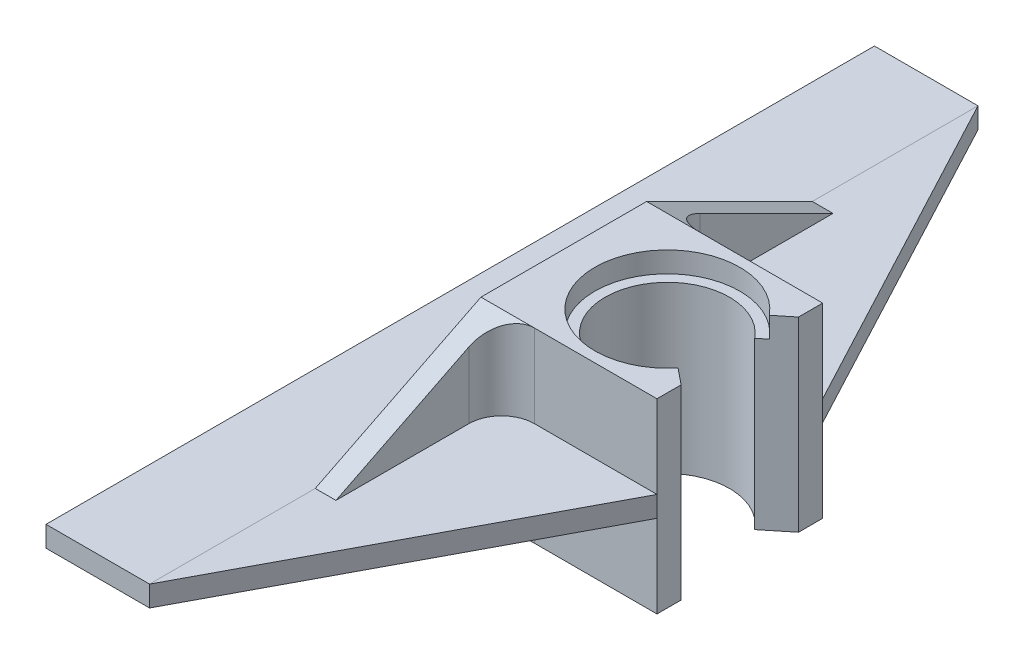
ISO-10303-21;
HEADER;
FILE_DESCRIPTION(('STEP AP214'),'2;1');
FILE_NAME('part.step','',(''),(''),'','','');
FILE_SCHEMA(('AUTOMOTIVE_DESIGN { 1 0 10303 214 1 1 1 1 }'));
ENDSEC;
DATA;
#1=APPLICATION_CONTEXT('core data for automotive mechanical design processes');
#2=APPLICATION_PROTOCOL_DEFINITION('international standard','automotive_design',2000,#1);
#3=PRODUCT_CONTEXT('',#1,'mechanical');
#4=PRODUCT('Part','Part','',(#3));
#5=PRODUCT_RELATED_PRODUCT_CATEGORY('part','',(#4));
#6=PRODUCT_DEFINITION_FORMATION('','',#4);
#7=PRODUCT_DEFINITION_CONTEXT('part definition',#1,'design');
#8=PRODUCT_DEFINITION('design','',#6,#7);
#9=PRODUCT_DEFINITION_SHAPE('','',#8);
#10=(LENGTH_UNIT() NAMED_UNIT(*) SI_UNIT(.MILLI.,.METRE.));
#11=(NAMED_UNIT(*) PLANE_ANGLE_UNIT() SI_UNIT($,.RADIAN.));
#12=(NAMED_UNIT(*) SI_UNIT($,.STERADIAN.) SOLID_ANGLE_UNIT());
#13=UNCERTAINTY_MEASURE_WITH_UNIT(LENGTH_MEASURE(1.E-05),#10,'distance_accuracy_value','');
#14=(GEOMETRIC_REPRESENTATION_CONTEXT(3) GLOBAL_UNCERTAINTY_ASSIGNED_CONTEXT((#13)) GLOBAL_UNIT_ASSIGNED_CONTEXT((#10,
#11,#12)) REPRESENTATION_CONTEXT('',''));
#15=CARTESIAN_POINT('',(0.,0.,0.));
#16=DIRECTION('',(0.,0.,1.));
#17=DIRECTION('',(1.,0.,0.));
#18=AXIS2_PLACEMENT_3D('',#15,#16,#17);
#19=CARTESIAN_POINT('',(-10.,-1.,-8.));
#20=DIRECTION('',(0.,1.,0.));
#21=DIRECTION('',(0.,0.,1.));
#22=AXIS2_PLACEMENT_3D('',#19,#20,#21);
#23=PLANE('',#22);
#24=DIRECTION('',(0.,0.,1.));
#25=VECTOR('',#24,1.);
#26=CARTESIAN_POINT('',(-10.,-1.,-8.));
#27=LINE('',#26,#25);
#28=CARTESIAN_POINT('',(-10.,-1.,-40.));
#29=VERTEX_POINT('',#28);
#30=CARTESIAN_POINT('',(-10.,-0.999999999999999,-24.));
#31=VERTEX_POINT('',#30);
#32=EDGE_CURVE('E11',#29,#31,#27,.T.);
#33=ORIENTED_EDGE('',*,*,#32,.F.);
#34=DIRECTION('',(-0.469155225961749,0.,-0.883115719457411));
#35=VECTOR('',#34,1.);
#36=CARTESIAN_POINT('',(7.,-1.,-8.));
#37=LINE('',#36,#35);
#38=CARTESIAN_POINT('',(7.,-1.,-8.));
#39=VERTEX_POINT('',#38);
#40=EDGE_CURVE('E526',#39,#29,#37,.T.);
#41=ORIENTED_EDGE('',*,*,#40,.F.);
#42=DIRECTION('',(1.,0.,0.));
#43=VECTOR('',#42,1.);
#44=CARTESIAN_POINT('',(7.,-1.,-8.));
#45=LINE('',#44,#43);
#46=CARTESIAN_POINT('',(-4.825,-1.,-8.));
#47=VERTEX_POINT('',#46);
#48=EDGE_CURVE('E429',#47,#39,#45,.T.);
#49=ORIENTED_EDGE('',*,*,#48,.F.);
#50=CARTESIAN_POINT('',(-4.825,-0.999999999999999,-11.175));
#51=DIRECTION('',(0.,1.,0.));
#52=DIRECTION('',(0.,0.,1.));
#53=AXIS2_PLACEMENT_3D('',#50,#51,#52);
#54=CIRCLE('',#53,3.175);
#55=CARTESIAN_POINT('',(-8.,-1.,-11.175));
#56=VERTEX_POINT('',#55);
#57=EDGE_CURVE('E317',#47,#56,#54,.F.);
#58=ORIENTED_EDGE('',*,*,#57,.T.);
#59=DIRECTION('',(0.,0.,-1.));
#60=VECTOR('',#59,1.);
#61=CARTESIAN_POINT('',(-8.,-1.,-8.));
#62=LINE('',#61,#60);
#63=CARTESIAN_POINT('',(-8.,-1.,-24.));
#64=VERTEX_POINT('',#63);
#65=EDGE_CURVE('E522',#56,#64,#62,.T.);
#66=ORIENTED_EDGE('',*,*,#65,.T.);
#67=DIRECTION('',(-1.,0.,0.));
#68=VECTOR('',#67,1.);
#69=CARTESIAN_POINT('',(-10.,-1.,-24.));
#70=LINE('',#69,#68);
#71=EDGE_CURVE('E306',#64,#31,#70,.T.);
#72=ORIENTED_EDGE('',*,*,#71,.T.);
#73=EDGE_LOOP('',(#33,#41,#49,#58,#66,#72));
#74=FACE_BOUND('',#73,.T.);
#75=ADVANCED_FACE('F32',(#74),#23,.F.);
#76=CARTESIAN_POINT('',(-10.,-0.999999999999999,24.));
#77=VERTEX_POINT('',#76);
#78=CARTESIAN_POINT('',(-10.,-1.,40.));
#79=VERTEX_POINT('',#78);
#80=EDGE_CURVE('E43',#77,#79,#27,.T.);
#81=ORIENTED_EDGE('',*,*,#80,.F.);
#82=DIRECTION('',(1.,0.,0.));
#83=VECTOR('',#82,1.);
#84=CARTESIAN_POINT('',(-10.,-1.,24.));
#85=LINE('',#84,#83);
#86=CARTESIAN_POINT('',(-8.,-1.,24.));
#87=VERTEX_POINT('',#86);
#88=EDGE_CURVE('E309',#77,#87,#85,.T.);
#89=ORIENTED_EDGE('',*,*,#88,.T.);
#90=CARTESIAN_POINT('',(-8.,-1.,11.175));
#91=VERTEX_POINT('',#90);
#92=EDGE_CURVE('E413',#87,#91,#62,.T.);
#93=ORIENTED_EDGE('',*,*,#92,.T.);
#94=CARTESIAN_POINT('',(-4.825,-0.999999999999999,11.175));
#95=DIRECTION('',(0.,1.,0.));
#96=DIRECTION('',(0.,0.,1.));
#97=AXIS2_PLACEMENT_3D('',#94,#95,#96);
#98=CIRCLE('',#97,3.175);
#99=CARTESIAN_POINT('',(-4.825,-1.,8.));
#100=VERTEX_POINT('',#99);
#101=EDGE_CURVE('E315',#91,#100,#98,.F.);
#102=ORIENTED_EDGE('',*,*,#101,.T.);
#103=DIRECTION('',(-1.,0.,0.));
#104=VECTOR('',#103,1.);
#105=CARTESIAN_POINT('',(-10.,-1.,8.));
#106=LINE('',#105,#104);
#107=CARTESIAN_POINT('',(7.,-1.,8.));
#108=VERTEX_POINT('',#107);
#109=EDGE_CURVE('E398',#108,#100,#106,.T.);
#110=ORIENTED_EDGE('',*,*,#109,.F.);
#111=DIRECTION('',(0.469155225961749,0.,-0.883115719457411));
#112=VECTOR('',#111,1.);
#113=CARTESIAN_POINT('',(7.,-1.,8.));
#114=LINE('',#113,#112);
#115=EDGE_CURVE('E387',#79,#108,#114,.T.);
#116=ORIENTED_EDGE('',*,*,#115,.F.);
#117=EDGE_LOOP('',(#81,#89,#93,#102,#110,#116));
#118=FACE_BOUND('',#117,.T.);
#119=ADVANCED_FACE('F396',(#118),#23,.F.);
#120=CARTESIAN_POINT('',(-10.,1.,-8.));
#121=DIRECTION('',(0.,1.,0.));
#122=DIRECTION('',(0.,0.,1.));
#123=AXIS2_PLACEMENT_3D('',#120,#121,#122);
#124=PLANE('',#123);
#125=DIRECTION('',(-0.469155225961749,0.,-0.883115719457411));
#126=VECTOR('',#125,1.);
#127=CARTESIAN_POINT('',(7.,1.,-8.));
#128=LINE('',#127,#126);
#129=CARTESIAN_POINT('',(7.,1.,-8.));
#130=VERTEX_POINT('',#129);
#131=CARTESIAN_POINT('',(-10.,1.,-40.));
#132=VERTEX_POINT('',#131);
#133=EDGE_CURVE('E412',#130,#132,#128,.T.);
#134=ORIENTED_EDGE('',*,*,#133,.T.);
#135=DIRECTION('',(0.,0.,1.));
#136=VECTOR('',#135,1.);
#137=CARTESIAN_POINT('',(-10.,1.,-8.));
#138=LINE('',#137,#136);
#139=CARTESIAN_POINT('',(-10.,1.,-24.));
#140=VERTEX_POINT('',#139);
#141=EDGE_CURVE('E351',#132,#140,#138,.T.);
#142=ORIENTED_EDGE('',*,*,#141,.T.);
#143=DIRECTION('',(-1.,0.,0.));
#144=VECTOR('',#143,1.);
#145=CARTESIAN_POINT('',(-10.,1.,-24.));
#146=LINE('',#145,#144);
#147=CARTESIAN_POINT('',(-8.,1.,-24.));
#148=VERTEX_POINT('',#147);
#149=EDGE_CURVE('E221',#148,#140,#146,.T.);
#150=ORIENTED_EDGE('',*,*,#149,.F.);
#151=DIRECTION('',(0.,0.,-1.));
#152=VECTOR('',#151,1.);
#153=CARTESIAN_POINT('',(-8.,1.,-8.));
#154=LINE('',#153,#152);
#155=CARTESIAN_POINT('',(-8.,1.,-11.175));
#156=VERTEX_POINT('',#155);
#157=EDGE_CURVE('E300',#156,#148,#154,.T.);
#158=ORIENTED_EDGE('',*,*,#157,.F.);
#159=CARTESIAN_POINT('',(-4.825,0.999999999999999,-11.175));
#160=DIRECTION('',(0.,1.,0.));
#161=DIRECTION('',(0.,0.,1.));
#162=AXIS2_PLACEMENT_3D('',#159,#160,#161);
#163=CIRCLE('',#162,3.175);
#164=CARTESIAN_POINT('',(-4.825,1.,-8.));
#165=VERTEX_POINT('',#164);
#166=EDGE_CURVE('E329',#156,#165,#163,.T.);
#167=ORIENTED_EDGE('',*,*,#166,.T.);
#168=DIRECTION('',(1.,0.,0.));
#169=VECTOR('',#168,1.);
#170=CARTESIAN_POINT('',(7.,1.,-8.));
#171=LINE('',#170,#169);
#172=EDGE_CURVE('E410',#165,#130,#171,.T.);
#173=ORIENTED_EDGE('',*,*,#172,.T.);
#174=EDGE_LOOP('',(#134,#142,#150,#158,#167,#173));
#175=FACE_BOUND('',#174,.T.);
#176=ADVANCED_FACE('F567',(#175),#124,.T.);
#177=DIRECTION('',(1.,0.,0.));
#178=VECTOR('',#177,1.);
#179=CARTESIAN_POINT('',(-10.,1.,24.));
#180=LINE('',#179,#178);
#181=CARTESIAN_POINT('',(-10.,1.,24.));
#182=VERTEX_POINT('',#181);
#183=CARTESIAN_POINT('',(-8.,1.,24.));
#184=VERTEX_POINT('',#183);
#185=EDGE_CURVE('E303',#182,#184,#180,.T.);
#186=ORIENTED_EDGE('',*,*,#185,.F.);
#187=CARTESIAN_POINT('',(-10.,1.,40.));
#188=VERTEX_POINT('',#187);
#189=EDGE_CURVE('E36',#182,#188,#138,.T.);
#190=ORIENTED_EDGE('',*,*,#189,.T.);
#191=DIRECTION('',(0.469155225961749,0.,-0.883115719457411));
#192=VECTOR('',#191,1.);
#193=CARTESIAN_POINT('',(7.,1.,8.));
#194=LINE('',#193,#192);
#195=CARTESIAN_POINT('',(7.,1.,8.));
#196=VERTEX_POINT('',#195);
#197=EDGE_CURVE('E389',#188,#196,#194,.T.);
#198=ORIENTED_EDGE('',*,*,#197,.T.);
#199=DIRECTION('',(-1.,0.,0.));
#200=VECTOR('',#199,1.);
#201=CARTESIAN_POINT('',(-10.,1.,8.));
#202=LINE('',#201,#200);
#203=CARTESIAN_POINT('',(-4.825,1.,8.));
#204=VERTEX_POINT('',#203);
#205=EDGE_CURVE('E424',#196,#204,#202,.T.);
#206=ORIENTED_EDGE('',*,*,#205,.T.);
#207=CARTESIAN_POINT('',(-4.825,0.999999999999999,11.175));
#208=DIRECTION('',(0.,1.,0.));
#209=DIRECTION('',(0.,0.,1.));
#210=AXIS2_PLACEMENT_3D('',#207,#208,#209);
#211=CIRCLE('',#210,3.175);
#212=CARTESIAN_POINT('',(-8.,1.,11.175));
#213=VERTEX_POINT('',#212);
#214=EDGE_CURVE('E331',#204,#213,#211,.T.);
#215=ORIENTED_EDGE('',*,*,#214,.T.);
#216=EDGE_CURVE('E304',#184,#213,#154,.T.);
#217=ORIENTED_EDGE('',*,*,#216,.F.);
#218=EDGE_LOOP('',(#186,#190,#198,#206,#215,#217));
#219=FACE_BOUND('',#218,.T.);
#220=ADVANCED_FACE('F559',(#219),#124,.T.);
#221=CARTESIAN_POINT('',(-10.,9.,-8.));
#222=DIRECTION('',(1.,0.,0.));
#223=DIRECTION('',(0.,0.,-1.));
#224=AXIS2_PLACEMENT_3D('',#221,#222,#223);
#225=PLANE('',#224);
#226=DIRECTION('',(0.,0.,-1.));
#227=VECTOR('',#226,1.);
#228=CARTESIAN_POINT('',(-10.,-1.,-8.));
#229=LINE('',#228,#227);
#230=EDGE_CURVE('E378',#77,#31,#229,.T.);
#231=ORIENTED_EDGE('',*,*,#230,.T.);
#232=DIRECTION('',(0.,-0.447213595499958,0.894427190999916));
#233=VECTOR('',#232,1.);
#234=CARTESIAN_POINT('',(-10.,0.,-26.));
#235=LINE('',#234,#233);
#236=CARTESIAN_POINT('',(-10.,-9.,-8.));
#237=VERTEX_POINT('',#236);
#238=EDGE_CURVE('E225',#31,#237,#235,.T.);
#239=ORIENTED_EDGE('',*,*,#238,.T.);
#240=DIRECTION('',(0.,0.,1.));
#241=VECTOR('',#240,1.);
#242=CARTESIAN_POINT('',(-10.,-9.,-8.));
#243=LINE('',#242,#241);
#244=CARTESIAN_POINT('',(-10.,-9.,8.));
#245=VERTEX_POINT('',#244);
#246=EDGE_CURVE('E260',#237,#245,#243,.T.);
#247=ORIENTED_EDGE('',*,*,#246,.T.);
#248=DIRECTION('',(0.,0.447213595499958,0.894427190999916));
#249=VECTOR('',#248,1.);
#250=CARTESIAN_POINT('',(-10.,0.,26.));
#251=LINE('',#250,#249);
#252=EDGE_CURVE('E517',#245,#77,#251,.T.);
#253=ORIENTED_EDGE('',*,*,#252,.T.);
#254=EDGE_LOOP('',(#231,#239,#247,#253));
#255=FACE_BOUND('',#254,.T.);
#256=ADVANCED_FACE('F557',(#255),#225,.F.);
#257=CARTESIAN_POINT('',(-10.,9.,8.));
#258=DIRECTION('',(0.,0.,-1.));
#259=DIRECTION('',(-1.,0.,0.));
#260=AXIS2_PLACEMENT_3D('',#257,#258,#259);
#261=PLANE('',#260);
#262=ORIENTED_EDGE('',*,*,#109,.T.);
#263=DIRECTION('',(0.,-1.,0.));
#264=VECTOR('',#263,1.);
#265=CARTESIAN_POINT('',(-4.825,9.,8.));
#266=LINE('',#265,#264);
#267=CARTESIAN_POINT('',(-4.825,-9.,8.));
#268=VERTEX_POINT('',#267);
#269=EDGE_CURVE('E321',#100,#268,#266,.T.);
#270=ORIENTED_EDGE('',*,*,#269,.T.);
#271=DIRECTION('',(1.,0.,0.));
#272=VECTOR('',#271,1.);
#273=CARTESIAN_POINT('',(-10.,-9.,8.));
#274=LINE('',#273,#272);
#275=CARTESIAN_POINT('',(7.,-9.,8.));
#276=VERTEX_POINT('',#275);
#277=EDGE_CURVE('E263',#268,#276,#274,.T.);
#278=ORIENTED_EDGE('',*,*,#277,.T.);
#279=DIRECTION('',(0.,-1.,0.));
#280=VECTOR('',#279,1.);
#281=CARTESIAN_POINT('',(7.,9.,8.));
#282=LINE('',#281,#280);
#283=EDGE_CURVE('E291',#108,#276,#282,.T.);
#284=ORIENTED_EDGE('',*,*,#283,.F.);
#285=EDGE_LOOP('',(#262,#270,#278,#284));
#286=FACE_BOUND('',#285,.T.);
#287=ADVANCED_FACE('F490',(#286),#261,.F.);
#288=CARTESIAN_POINT('',(-10.,9.,-8.));
#289=DIRECTION('',(0.,0.,1.));
#290=DIRECTION('',(1.,0.,0.));
#291=AXIS2_PLACEMENT_3D('',#288,#289,#290);
#292=PLANE('',#291);
#293=DIRECTION('',(-1.,0.,0.));
#294=VECTOR('',#293,1.);
#295=CARTESIAN_POINT('',(-10.,-9.,-8.));
#296=LINE('',#295,#294);
#297=CARTESIAN_POINT('',(7.,-9.,-8.));
#298=VERTEX_POINT('',#297);
#299=CARTESIAN_POINT('',(-4.825,-9.,-8.));
#300=VERTEX_POINT('',#299);
#301=EDGE_CURVE('E239',#298,#300,#296,.T.);
#302=ORIENTED_EDGE('',*,*,#301,.T.);
#303=DIRECTION('',(0.,1.,0.));
#304=VECTOR('',#303,1.);
#305=CARTESIAN_POINT('',(-4.825,9.,-8.));
#306=LINE('',#305,#304);
#307=EDGE_CURVE('E312',#300,#47,#306,.T.);
#308=ORIENTED_EDGE('',*,*,#307,.T.);
#309=ORIENTED_EDGE('',*,*,#48,.T.);
#310=DIRECTION('',(0.,-1.,0.));
#311=VECTOR('',#310,1.);
#312=CARTESIAN_POINT('',(7.,9.,-8.));
#313=LINE('',#312,#311);
#314=EDGE_CURVE('E259',#39,#298,#313,.T.);
#315=ORIENTED_EDGE('',*,*,#314,.T.);
#316=EDGE_LOOP('',(#302,#308,#309,#315));
#317=FACE_BOUND('',#316,.T.);
#318=ADVANCED_FACE('F542',(#317),#292,.F.);
#319=CARTESIAN_POINT('',(0.,9.,0.));
#320=DIRECTION('',(0.,-1.,0.));
#321=DIRECTION('',(0.,0.,-1.));
#322=AXIS2_PLACEMENT_3D('',#319,#320,#321);
#323=CYLINDRICAL_SURFACE('',#322,6.);
#324=CARTESIAN_POINT('',(0.,7.,0.));
#325=DIRECTION('',(0.,1.,0.));
#326=DIRECTION('',(0.,0.,1.));
#327=AXIS2_PLACEMENT_3D('',#324,#325,#326);
#328=CIRCLE('',#327,6.);
#329=CARTESIAN_POINT('',(4.66287576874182,7.,3.77592234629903));
#330=VERTEX_POINT('',#329);
#331=CARTESIAN_POINT('',(4.66287576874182,7.,-3.77592234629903));
#332=VERTEX_POINT('',#331);
#333=EDGE_CURVE('E447',#330,#332,#328,.F.);
#334=ORIENTED_EDGE('',*,*,#333,.F.);
#335=DIRECTION('',(0.,-1.,0.));
#336=VECTOR('',#335,1.);
#337=CARTESIAN_POINT('',(4.66287576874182,9.,3.77592234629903));
#338=LINE('',#337,#336);
#339=CARTESIAN_POINT('',(4.66287576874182,-9.,3.77592234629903));
#340=VERTEX_POINT('',#339);
#341=EDGE_CURVE('E286',#330,#340,#338,.T.);
#342=ORIENTED_EDGE('',*,*,#341,.T.);
#343=CARTESIAN_POINT('',(0.,-9.,0.));
#344=DIRECTION('',(0.,-1.,0.));
#345=DIRECTION('',(0.,0.,1.));
#346=AXIS2_PLACEMENT_3D('',#343,#344,#345);
#347=CIRCLE('',#346,6.);
#348=CARTESIAN_POINT('',(4.66287576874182,-9.,-3.77592234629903));
#349=VERTEX_POINT('',#348);
#350=EDGE_CURVE('E271',#340,#349,#347,.T.);
#351=ORIENTED_EDGE('',*,*,#350,.T.);
#352=DIRECTION('',(0.,-1.,0.));
#353=VECTOR('',#352,1.);
#354=CARTESIAN_POINT('',(4.66287576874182,9.,-3.77592234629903));
#355=LINE('',#354,#353);
#356=EDGE_CURVE('E284',#332,#349,#355,.T.);
#357=ORIENTED_EDGE('',*,*,#356,.F.);
#358=EDGE_LOOP('',(#334,#342,#351,#357));
#359=FACE_BOUND('',#358,.T.);
#360=ADVANCED_FACE('F458',(#359),#323,.F.);
#361=DIRECTION('',(0.,0.,1.));
#362=VECTOR('',#361,1.);
#363=CARTESIAN_POINT('',(-10.,9.,-8.));
#364=LINE('',#363,#362);
#365=CARTESIAN_POINT('',(-10.,9.,-8.));
#366=VERTEX_POINT('',#365);
#367=CARTESIAN_POINT('',(-10.,9.,8.));
#368=VERTEX_POINT('',#367);
#369=EDGE_CURVE('E229',#366,#368,#364,.T.);
#370=ORIENTED_EDGE('',*,*,#369,.F.);
#371=DIRECTION('',(0.,-0.447213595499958,-0.894427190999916));
#372=VECTOR('',#371,1.);
#373=CARTESIAN_POINT('',(-10.,9.,-8.));
#374=LINE('',#373,#372);
#375=EDGE_CURVE('E215',#366,#140,#374,.T.);
#376=ORIENTED_EDGE('',*,*,#375,.T.);
#377=DIRECTION('',(0.,0.,-1.));
#378=VECTOR('',#377,1.);
#379=CARTESIAN_POINT('',(-10.,1.,-8.));
#380=LINE('',#379,#378);
#381=EDGE_CURVE('E427',#182,#140,#380,.T.);
#382=ORIENTED_EDGE('',*,*,#381,.F.);
#383=DIRECTION('',(0.,0.447213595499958,-0.894427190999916));
#384=VECTOR('',#383,1.);
#385=CARTESIAN_POINT('',(-10.,9.,8.));
#386=LINE('',#385,#384);
#387=EDGE_CURVE('E237',#182,#368,#386,.T.);
#388=ORIENTED_EDGE('',*,*,#387,.T.);
#389=EDGE_LOOP('',(#370,#376,#382,#388));
#390=FACE_BOUND('',#389,.T.);
#391=ADVANCED_FACE('F235',(#390),#225,.F.);
#392=DIRECTION('',(1.,0.,0.));
#393=VECTOR('',#392,1.);
#394=CARTESIAN_POINT('',(-10.,9.,8.));
#395=LINE('',#394,#393);
#396=CARTESIAN_POINT('',(-4.825,9.,8.));
#397=VERTEX_POINT('',#396);
#398=CARTESIAN_POINT('',(7.,9.,8.));
#399=VERTEX_POINT('',#398);
#400=EDGE_CURVE('E238',#397,#399,#395,.T.);
#401=ORIENTED_EDGE('',*,*,#400,.F.);
#402=DIRECTION('',(0.,-1.,0.));
#403=VECTOR('',#402,1.);
#404=CARTESIAN_POINT('',(-4.825,9.,8.));
#405=LINE('',#404,#403);
#406=EDGE_CURVE('E326',#397,#204,#405,.T.);
#407=ORIENTED_EDGE('',*,*,#406,.T.);
#408=ORIENTED_EDGE('',*,*,#205,.F.);
#409=EDGE_CURVE('E292',#399,#196,#282,.T.);
#410=ORIENTED_EDGE('',*,*,#409,.F.);
#411=EDGE_LOOP('',(#401,#407,#408,#410));
#412=FACE_BOUND('',#411,.T.);
#413=ADVANCED_FACE('F566',(#412),#261,.F.);
#414=CARTESIAN_POINT('',(7.,9.,5.66848823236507));
#415=DIRECTION('',(-1.,0.,0.));
#416=DIRECTION('',(0.,0.,1.));
#417=AXIS2_PLACEMENT_3D('',#414,#415,#416);
#418=PLANE('',#417);
#419=DIRECTION('',(0.,0.,-1.));
#420=VECTOR('',#419,1.);
#421=CARTESIAN_POINT('',(7.,-9.,5.66848823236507));
#422=LINE('',#421,#420);
#423=CARTESIAN_POINT('',(7.,-9.,5.66848823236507));
#424=VERTEX_POINT('',#423);
#425=EDGE_CURVE('E266',#276,#424,#422,.T.);
#426=ORIENTED_EDGE('',*,*,#425,.T.);
#427=DIRECTION('',(0.,-1.,0.));
#428=VECTOR('',#427,1.);
#429=CARTESIAN_POINT('',(7.,9.,5.66848823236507));
#430=LINE('',#429,#428);
#431=CARTESIAN_POINT('',(7.,9.,5.66848823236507));
#432=VERTEX_POINT('',#431);
#433=EDGE_CURVE('E288',#432,#424,#430,.T.);
#434=ORIENTED_EDGE('',*,*,#433,.F.);
#435=DIRECTION('',(0.,0.,-1.));
#436=VECTOR('',#435,1.);
#437=CARTESIAN_POINT('',(7.,9.,5.66848823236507));
#438=LINE('',#437,#436);
#439=EDGE_CURVE('E249',#399,#432,#438,.T.);
#440=ORIENTED_EDGE('',*,*,#439,.F.);
#441=ORIENTED_EDGE('',*,*,#409,.T.);
#442=DIRECTION('',(0.,1.,0.));
#443=VECTOR('',#442,1.);
#444=CARTESIAN_POINT('',(7.,-1.,8.));
#445=LINE('',#444,#443);
#446=EDGE_CURVE('E393',#108,#196,#445,.T.);
#447=ORIENTED_EDGE('',*,*,#446,.F.);
#448=ORIENTED_EDGE('',*,*,#283,.T.);
#449=EDGE_LOOP('',(#426,#434,#440,#441,#447,#448));
#450=FACE_BOUND('',#449,.T.);
#451=ADVANCED_FACE('F486',(#450),#418,.F.);
#452=CARTESIAN_POINT('',(4.66287576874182,9.,3.77592234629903));
#453=DIRECTION('',(-0.629320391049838,0.,0.77714596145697));
#454=DIRECTION('',(0.77714596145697,0.,0.629320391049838));
#455=AXIS2_PLACEMENT_3D('',#452,#453,#454);
#456=PLANE('',#455);
#457=DIRECTION('',(-0.77714596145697,0.,-0.629320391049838));
#458=VECTOR('',#457,1.);
#459=CARTESIAN_POINT('',(4.66287576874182,7.,3.77592234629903));
#460=LINE('',#459,#458);
#461=CARTESIAN_POINT('',(5.44002173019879,7.,4.40524273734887));
#462=VERTEX_POINT('',#461);
#463=EDGE_CURVE('E246',#462,#330,#460,.T.);
#464=ORIENTED_EDGE('',*,*,#463,.F.);
#465=DIRECTION('',(0.,1.,0.));
#466=VECTOR('',#465,1.);
#467=CARTESIAN_POINT('',(5.44002173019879,7.,4.40524273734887));
#468=LINE('',#467,#466);
#469=CARTESIAN_POINT('',(5.44002173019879,9.,4.40524273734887));
#470=VERTEX_POINT('',#469);
#471=EDGE_CURVE('E445',#462,#470,#468,.T.);
#472=ORIENTED_EDGE('',*,*,#471,.T.);
#473=DIRECTION('',(-0.77714596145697,0.,-0.629320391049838));
#474=VECTOR('',#473,1.);
#475=CARTESIAN_POINT('',(4.66287576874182,9.,3.77592234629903));
#476=LINE('',#475,#474);
#477=EDGE_CURVE('E251',#432,#470,#476,.T.);
#478=ORIENTED_EDGE('',*,*,#477,.F.);
#479=ORIENTED_EDGE('',*,*,#433,.T.);
#480=DIRECTION('',(-0.77714596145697,0.,-0.629320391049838));
#481=VECTOR('',#480,1.);
#482=CARTESIAN_POINT('',(4.66287576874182,-9.,3.77592234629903));
#483=LINE('',#482,#481);
#484=EDGE_CURVE('E268',#424,#340,#483,.T.);
#485=ORIENTED_EDGE('',*,*,#484,.T.);
#486=ORIENTED_EDGE('',*,*,#341,.F.);
#487=EDGE_LOOP('',(#464,#472,#478,#479,#485,#486));
#488=FACE_BOUND('',#487,.T.);
#489=ADVANCED_FACE('F459',(#488),#456,.F.);
#490=CARTESIAN_POINT('',(4.66287576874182,9.,-3.77592234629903));
#491=DIRECTION('',(-0.629320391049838,0.,-0.77714596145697));
#492=DIRECTION('',(-0.77714596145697,0.,0.629320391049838));
#493=AXIS2_PLACEMENT_3D('',#490,#491,#492);
#494=PLANE('',#493);
#495=DIRECTION('',(0.77714596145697,0.,-0.629320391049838));
#496=VECTOR('',#495,1.);
#497=CARTESIAN_POINT('',(4.66287576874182,9.,-3.77592234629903));
#498=LINE('',#497,#496);
#499=CARTESIAN_POINT('',(5.44002173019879,9.,-4.40524273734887));
#500=VERTEX_POINT('',#499);
#501=CARTESIAN_POINT('',(7.,9.,-5.66848823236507));
#502=VERTEX_POINT('',#501);
#503=EDGE_CURVE('E254',#500,#502,#498,.T.);
#504=ORIENTED_EDGE('',*,*,#503,.F.);
#505=DIRECTION('',(0.,1.,0.));
#506=VECTOR('',#505,1.);
#507=CARTESIAN_POINT('',(5.44002173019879,7.,-4.40524273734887));
#508=LINE('',#507,#506);
#509=CARTESIAN_POINT('',(5.44002173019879,7.,-4.40524273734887));
#510=VERTEX_POINT('',#509);
#511=EDGE_CURVE('E442',#500,#510,#508,.F.);
#512=ORIENTED_EDGE('',*,*,#511,.T.);
#513=DIRECTION('',(0.77714596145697,0.,-0.629320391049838));
#514=VECTOR('',#513,1.);
#515=CARTESIAN_POINT('',(4.66287576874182,7.,-3.77592234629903));
#516=LINE('',#515,#514);
#517=EDGE_CURVE('E297',#332,#510,#516,.T.);
#518=ORIENTED_EDGE('',*,*,#517,.F.);
#519=ORIENTED_EDGE('',*,*,#356,.T.);
#520=DIRECTION('',(0.77714596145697,0.,-0.629320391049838));
#521=VECTOR('',#520,1.);
#522=CARTESIAN_POINT('',(4.66287576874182,-9.,-3.77592234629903));
#523=LINE('',#522,#521);
#524=CARTESIAN_POINT('',(7.,-9.,-5.66848823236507));
#525=VERTEX_POINT('',#524);
#526=EDGE_CURVE('E274',#349,#525,#523,.T.);
#527=ORIENTED_EDGE('',*,*,#526,.T.);
#528=DIRECTION('',(0.,-1.,0.));
#529=VECTOR('',#528,1.);
#530=CARTESIAN_POINT('',(7.,9.,-5.66848823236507));
#531=LINE('',#530,#529);
#532=EDGE_CURVE('E281',#502,#525,#531,.T.);
#533=ORIENTED_EDGE('',*,*,#532,.F.);
#534=EDGE_LOOP('',(#504,#512,#518,#519,#527,#533));
#535=FACE_BOUND('',#534,.T.);
#536=ADVANCED_FACE('F474',(#535),#494,.F.);
#537=CARTESIAN_POINT('',(7.,9.,-8.));
#538=DIRECTION('',(-1.,0.,0.));
#539=DIRECTION('',(0.,0.,1.));
#540=AXIS2_PLACEMENT_3D('',#537,#538,#539);
#541=PLANE('',#540);
#542=DIRECTION('',(0.,0.,-1.));
#543=VECTOR('',#542,1.);
#544=CARTESIAN_POINT('',(7.,-9.,-8.));
#545=LINE('',#544,#543);
#546=EDGE_CURVE('E243',#525,#298,#545,.T.);
#547=ORIENTED_EDGE('',*,*,#546,.T.);
#548=ORIENTED_EDGE('',*,*,#314,.F.);
#549=DIRECTION('',(0.,1.,0.));
#550=VECTOR('',#549,1.);
#551=CARTESIAN_POINT('',(7.,-1.,-8.));
#552=LINE('',#551,#550);
#553=EDGE_CURVE('E409',#39,#130,#552,.T.);
#554=ORIENTED_EDGE('',*,*,#553,.T.);
#555=CARTESIAN_POINT('',(7.,9.,-8.));
#556=VERTEX_POINT('',#555);
#557=EDGE_CURVE('E278',#556,#130,#313,.T.);
#558=ORIENTED_EDGE('',*,*,#557,.F.);
#559=DIRECTION('',(0.,0.,-1.));
#560=VECTOR('',#559,1.);
#561=CARTESIAN_POINT('',(7.,9.,-8.));
#562=LINE('',#561,#560);
#563=EDGE_CURVE('E256',#502,#556,#562,.T.);
#564=ORIENTED_EDGE('',*,*,#563,.F.);
#565=ORIENTED_EDGE('',*,*,#532,.T.);
#566=EDGE_LOOP('',(#547,#548,#554,#558,#564,#565));
#567=FACE_BOUND('',#566,.T.);
#568=ADVANCED_FACE('F477',(#567),#541,.F.);
#569=ORIENTED_EDGE('',*,*,#172,.F.);
#570=DIRECTION('',(0.,1.,0.));
#571=VECTOR('',#570,1.);
#572=CARTESIAN_POINT('',(-4.825,9.,-8.));
#573=LINE('',#572,#571);
#574=CARTESIAN_POINT('',(-4.825,9.,-8.));
#575=VERTEX_POINT('',#574);
#576=EDGE_CURVE('E335',#165,#575,#573,.T.);
#577=ORIENTED_EDGE('',*,*,#576,.T.);
#578=DIRECTION('',(-1.,0.,0.));
#579=VECTOR('',#578,1.);
#580=CARTESIAN_POINT('',(-10.,9.,-8.));
#581=LINE('',#580,#579);
#582=EDGE_CURVE('E231',#556,#575,#581,.T.);
#583=ORIENTED_EDGE('',*,*,#582,.F.);
#584=ORIENTED_EDGE('',*,*,#557,.T.);
#585=EDGE_LOOP('',(#569,#577,#583,#584));
#586=FACE_BOUND('',#585,.T.);
#587=ADVANCED_FACE('F599',(#586),#292,.F.);
#588=CARTESIAN_POINT('',(0.,9.,0.));
#589=DIRECTION('',(0.,1.,0.));
#590=DIRECTION('',(0.,0.,1.));
#591=AXIS2_PLACEMENT_3D('',#588,#589,#590);
#592=PLANE('',#591);
#593=ORIENTED_EDGE('',*,*,#582,.T.);
#594=DIRECTION('',(-1.,0.,0.));
#595=VECTOR('',#594,1.);
#596=CARTESIAN_POINT('',(-8.,9.,-8.));
#597=LINE('',#596,#595);
#598=EDGE_CURVE('E218',#575,#366,#597,.T.);
#599=ORIENTED_EDGE('',*,*,#598,.T.);
#600=ORIENTED_EDGE('',*,*,#369,.T.);
#601=EDGE_CURVE('E50',#368,#397,#395,.T.);
#602=ORIENTED_EDGE('',*,*,#601,.T.);
#603=ORIENTED_EDGE('',*,*,#400,.T.);
#604=ORIENTED_EDGE('',*,*,#439,.T.);
#605=ORIENTED_EDGE('',*,*,#477,.T.);
#606=CARTESIAN_POINT('',(0.,9.,0.));
#607=DIRECTION('',(0.,1.,0.));
#608=DIRECTION('',(0.,0.,1.));
#609=AXIS2_PLACEMENT_3D('',#606,#607,#608);
#610=CIRCLE('',#609,7.);
#611=EDGE_CURVE('E295',#500,#470,#610,.T.);
#612=ORIENTED_EDGE('',*,*,#611,.F.);
#613=ORIENTED_EDGE('',*,*,#503,.T.);
#614=ORIENTED_EDGE('',*,*,#563,.T.);
#615=EDGE_LOOP('',(#593,#599,#600,#602,#603,#604,#605,#612,#613,#614));
#616=FACE_BOUND('',#615,.T.);
#617=ADVANCED_FACE('F228',(#616),#592,.T.);
#618=CARTESIAN_POINT('',(0.,-9.,0.));
#619=DIRECTION('',(0.,1.,0.));
#620=DIRECTION('',(0.,0.,1.));
#621=AXIS2_PLACEMENT_3D('',#618,#619,#620);
#622=PLANE('',#621);
#623=ORIENTED_EDGE('',*,*,#277,.F.);
#624=EDGE_CURVE('E264',#245,#268,#274,.T.);
#625=ORIENTED_EDGE('',*,*,#624,.F.);
#626=ORIENTED_EDGE('',*,*,#246,.F.);
#627=DIRECTION('',(-1.,0.,0.));
#628=VECTOR('',#627,1.);
#629=CARTESIAN_POINT('',(-8.,-9.,-8.));
#630=LINE('',#629,#628);
#631=EDGE_CURVE('E232',#300,#237,#630,.T.);
#632=ORIENTED_EDGE('',*,*,#631,.F.);
#633=ORIENTED_EDGE('',*,*,#301,.F.);
#634=ORIENTED_EDGE('',*,*,#546,.F.);
#635=ORIENTED_EDGE('',*,*,#526,.F.);
#636=ORIENTED_EDGE('',*,*,#350,.F.);
#637=ORIENTED_EDGE('',*,*,#484,.F.);
#638=ORIENTED_EDGE('',*,*,#425,.F.);
#639=EDGE_LOOP('',(#623,#625,#626,#632,#633,#634,#635,#636,#637,#638));
#640=FACE_BOUND('',#639,.T.);
#641=ADVANCED_FACE('F468',(#640),#622,.F.);
#642=CARTESIAN_POINT('',(0.,7.,0.));
#643=DIRECTION('',(0.,1.,0.));
#644=DIRECTION('',(0.,0.,1.));
#645=AXIS2_PLACEMENT_3D('',#642,#643,#644);
#646=PLANE('',#645);
#647=ORIENTED_EDGE('',*,*,#463,.T.);
#648=ORIENTED_EDGE('',*,*,#333,.T.);
#649=ORIENTED_EDGE('',*,*,#517,.T.);
#650=CARTESIAN_POINT('',(0.,7.,0.));
#651=DIRECTION('',(0.,1.,0.));
#652=DIRECTION('',(0.,0.,1.));
#653=AXIS2_PLACEMENT_3D('',#650,#651,#652);
#654=CIRCLE('',#653,7.);
#655=EDGE_CURVE('E430',#510,#462,#654,.T.);
#656=ORIENTED_EDGE('',*,*,#655,.T.);
#657=EDGE_LOOP('',(#647,#648,#649,#656));
#658=FACE_BOUND('',#657,.T.);
#659=ADVANCED_FACE('F452',(#658),#646,.T.);
#660=CARTESIAN_POINT('',(0.,7.,0.));
#661=DIRECTION('',(0.,1.,0.));
#662=DIRECTION('',(0.,0.,1.));
#663=AXIS2_PLACEMENT_3D('',#660,#661,#662);
#664=CYLINDRICAL_SURFACE('',#663,7.);
#665=ORIENTED_EDGE('',*,*,#655,.F.);
#666=ORIENTED_EDGE('',*,*,#511,.F.);
#667=ORIENTED_EDGE('',*,*,#611,.T.);
#668=ORIENTED_EDGE('',*,*,#471,.F.);
#669=EDGE_LOOP('',(#665,#666,#667,#668));
#670=FACE_BOUND('',#669,.T.);
#671=ADVANCED_FACE('F482',(#670),#664,.F.);
#672=CARTESIAN_POINT('',(7.,-1.,8.));
#673=DIRECTION('',(0.883115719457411,0.,0.469155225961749));
#674=DIRECTION('',(0.469155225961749,0.,-0.883115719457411));
#675=AXIS2_PLACEMENT_3D('',#672,#673,#674);
#676=PLANE('',#675);
#677=ORIENTED_EDGE('',*,*,#197,.F.);
#678=DIRECTION('',(0.,1.,0.));
#679=VECTOR('',#678,1.);
#680=CARTESIAN_POINT('',(-10.,-1.,40.));
#681=LINE('',#680,#679);
#682=EDGE_CURVE('E385',#79,#188,#681,.T.);
#683=ORIENTED_EDGE('',*,*,#682,.F.);
#684=ORIENTED_EDGE('',*,*,#115,.T.);
#685=ORIENTED_EDGE('',*,*,#446,.T.);
#686=EDGE_LOOP('',(#677,#683,#684,#685));
#687=FACE_BOUND('',#686,.T.);
#688=ADVANCED_FACE('F386',(#687),#676,.T.);
#689=CARTESIAN_POINT('',(-10.,-1.,40.));
#690=DIRECTION('',(0.,0.,1.));
#691=DIRECTION('',(1.,0.,0.));
#692=AXIS2_PLACEMENT_3D('',#689,#690,#691);
#693=PLANE('',#692);
#694=DIRECTION('',(1.,0.,0.));
#695=VECTOR('',#694,1.);
#696=CARTESIAN_POINT('',(-10.,1.,40.));
#697=LINE('',#696,#695);
#698=CARTESIAN_POINT('',(-20.,1.,40.));
#699=VERTEX_POINT('',#698);
#700=EDGE_CURVE('E421',#699,#188,#697,.T.);
#701=ORIENTED_EDGE('',*,*,#700,.F.);
#702=DIRECTION('',(0.,1.,0.));
#703=VECTOR('',#702,1.);
#704=CARTESIAN_POINT('',(-20.,-1.,40.));
#705=LINE('',#704,#703);
#706=CARTESIAN_POINT('',(-20.,-1.,40.));
#707=VERTEX_POINT('',#706);
#708=EDGE_CURVE('E394',#707,#699,#705,.T.);
#709=ORIENTED_EDGE('',*,*,#708,.F.);
#710=DIRECTION('',(1.,0.,0.));
#711=VECTOR('',#710,1.);
#712=CARTESIAN_POINT('',(-10.,-1.,40.));
#713=LINE('',#712,#711);
#714=EDGE_CURVE('E375',#707,#79,#713,.T.);
#715=ORIENTED_EDGE('',*,*,#714,.T.);
#716=ORIENTED_EDGE('',*,*,#682,.T.);
#717=EDGE_LOOP('',(#701,#709,#715,#716));
#718=FACE_BOUND('',#717,.T.);
#719=ADVANCED_FACE('F400',(#718),#693,.T.);
#720=CARTESIAN_POINT('',(-20.,-1.,-40.));
#721=DIRECTION('',(-1.,0.,0.));
#722=DIRECTION('',(0.,0.,1.));
#723=AXIS2_PLACEMENT_3D('',#720,#721,#722);
#724=PLANE('',#723);
#725=DIRECTION('',(0.,0.,1.));
#726=VECTOR('',#725,1.);
#727=CARTESIAN_POINT('',(-20.,1.,-40.));
#728=LINE('',#727,#726);
#729=CARTESIAN_POINT('',(-20.,1.,-40.));
#730=VERTEX_POINT('',#729);
#731=EDGE_CURVE('E418',#730,#699,#728,.T.);
#732=ORIENTED_EDGE('',*,*,#731,.F.);
#733=DIRECTION('',(0.,1.,0.));
#734=VECTOR('',#733,1.);
#735=CARTESIAN_POINT('',(-20.,-1.,-40.));
#736=LINE('',#735,#734);
#737=CARTESIAN_POINT('',(-20.,-1.,-40.));
#738=VERTEX_POINT('',#737);
#739=EDGE_CURVE('E433',#738,#730,#736,.T.);
#740=ORIENTED_EDGE('',*,*,#739,.F.);
#741=DIRECTION('',(0.,0.,1.));
#742=VECTOR('',#741,1.);
#743=CARTESIAN_POINT('',(-20.,-1.,-40.));
#744=LINE('',#743,#742);
#745=EDGE_CURVE('E401',#738,#707,#744,.T.);
#746=ORIENTED_EDGE('',*,*,#745,.T.);
#747=ORIENTED_EDGE('',*,*,#708,.T.);
#748=EDGE_LOOP('',(#732,#740,#746,#747));
#749=FACE_BOUND('',#748,.T.);
#750=ADVANCED_FACE('F589',(#749),#724,.T.);
#751=CARTESIAN_POINT('',(-10.,-1.,-40.));
#752=DIRECTION('',(0.,0.,-1.));
#753=DIRECTION('',(-1.,0.,0.));
#754=AXIS2_PLACEMENT_3D('',#751,#752,#753);
#755=PLANE('',#754);
#756=DIRECTION('',(-1.,0.,0.));
#757=VECTOR('',#756,1.);
#758=CARTESIAN_POINT('',(-10.,1.,-40.));
#759=LINE('',#758,#757);
#760=EDGE_CURVE('E415',#132,#730,#759,.T.);
#761=ORIENTED_EDGE('',*,*,#760,.F.);
#762=DIRECTION('',(0.,1.,0.));
#763=VECTOR('',#762,1.);
#764=CARTESIAN_POINT('',(-10.,-1.,-40.));
#765=LINE('',#764,#763);
#766=EDGE_CURVE('E435',#29,#132,#765,.T.);
#767=ORIENTED_EDGE('',*,*,#766,.F.);
#768=DIRECTION('',(-1.,0.,0.));
#769=VECTOR('',#768,1.);
#770=CARTESIAN_POINT('',(-10.,-1.,-40.));
#771=LINE('',#770,#769);
#772=EDGE_CURVE('E403',#29,#738,#771,.T.);
#773=ORIENTED_EDGE('',*,*,#772,.T.);
#774=ORIENTED_EDGE('',*,*,#739,.T.);
#775=EDGE_LOOP('',(#761,#767,#773,#774));
#776=FACE_BOUND('',#775,.T.);
#777=ADVANCED_FACE('F532',(#776),#755,.T.);
#778=CARTESIAN_POINT('',(7.,-1.,-8.));
#779=DIRECTION('',(0.883115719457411,0.,-0.469155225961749));
#780=DIRECTION('',(-0.469155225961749,0.,-0.883115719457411));
#781=AXIS2_PLACEMENT_3D('',#778,#779,#780);
#782=PLANE('',#781);
#783=ORIENTED_EDGE('',*,*,#133,.F.);
#784=ORIENTED_EDGE('',*,*,#553,.F.);
#785=ORIENTED_EDGE('',*,*,#40,.T.);
#786=ORIENTED_EDGE('',*,*,#766,.T.);
#787=EDGE_LOOP('',(#783,#784,#785,#786));
#788=FACE_BOUND('',#787,.T.);
#789=ADVANCED_FACE('F538',(#788),#782,.T.);
#790=ORIENTED_EDGE('',*,*,#772,.F.);
#791=ORIENTED_EDGE('',*,*,#32,.T.);
#792=ORIENTED_EDGE('',*,*,#230,.F.);
#793=ORIENTED_EDGE('',*,*,#80,.T.);
#794=ORIENTED_EDGE('',*,*,#714,.F.);
#795=ORIENTED_EDGE('',*,*,#745,.F.);
#796=EDGE_LOOP('',(#790,#791,#792,#793,#794,#795));
#797=FACE_BOUND('',#796,.T.);
#798=ADVANCED_FACE('F372',(#797),#23,.F.);
#799=ORIENTED_EDGE('',*,*,#141,.F.);
#800=ORIENTED_EDGE('',*,*,#760,.T.);
#801=ORIENTED_EDGE('',*,*,#731,.T.);
#802=ORIENTED_EDGE('',*,*,#700,.T.);
#803=ORIENTED_EDGE('',*,*,#189,.F.);
#804=ORIENTED_EDGE('',*,*,#381,.T.);
#805=EDGE_LOOP('',(#799,#800,#801,#802,#803,#804));
#806=FACE_BOUND('',#805,.T.);
#807=ADVANCED_FACE('F569',(#806),#124,.T.);
#808=CARTESIAN_POINT('',(-8.,9.,7.99999999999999));
#809=DIRECTION('',(1.,0.,0.));
#810=DIRECTION('',(0.,0.,-1.));
#811=AXIS2_PLACEMENT_3D('',#808,#809,#810);
#812=PLANE('',#811);
#813=DIRECTION('',(0.,-0.447213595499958,-0.894427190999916));
#814=VECTOR('',#813,1.);
#815=CARTESIAN_POINT('',(-8.,9.,-8.));
#816=LINE('',#815,#814);
#817=CARTESIAN_POINT('',(-8.,7.4125,-11.175));
#818=VERTEX_POINT('',#817);
#819=EDGE_CURVE('E511',#818,#148,#816,.T.);
#820=ORIENTED_EDGE('',*,*,#819,.F.);
#821=DIRECTION('',(0.,1.,0.));
#822=VECTOR('',#821,1.);
#823=CARTESIAN_POINT('',(-8.,9.,-11.175));
#824=LINE('',#823,#822);
#825=EDGE_CURVE('E338',#818,#156,#824,.F.);
#826=ORIENTED_EDGE('',*,*,#825,.T.);
#827=ORIENTED_EDGE('',*,*,#157,.T.);
#828=EDGE_LOOP('',(#820,#826,#827));
#829=FACE_BOUND('',#828,.T.);
#830=ADVANCED_FACE('F583',(#829),#812,.T.);
#831=CARTESIAN_POINT('',(-8.,9.,-8.));
#832=DIRECTION('',(0.,0.894427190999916,-0.447213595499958));
#833=DIRECTION('',(0.,0.447213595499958,0.894427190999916));
#834=AXIS2_PLACEMENT_3D('',#831,#832,#833);
#835=PLANE('',#834);
#836=ORIENTED_EDGE('',*,*,#598,.F.);
#837=CARTESIAN_POINT('',(-4.825,7.4125,-11.175));
#838=DIRECTION('',(0.,0.894427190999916,-0.447213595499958));
#839=DIRECTION('',(0.,0.447213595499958,0.894427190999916));
#840=AXIS2_PLACEMENT_3D('',#837,#838,#839);
#841=ELLIPSE('',#840,3.54975791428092,3.175);
#842=EDGE_CURVE('E348',#575,#818,#841,.F.);
#843=ORIENTED_EDGE('',*,*,#842,.T.);
#844=ORIENTED_EDGE('',*,*,#819,.T.);
#845=ORIENTED_EDGE('',*,*,#149,.T.);
#846=ORIENTED_EDGE('',*,*,#375,.F.);
#847=EDGE_LOOP('',(#836,#843,#844,#845,#846));
#848=FACE_BOUND('',#847,.T.);
#849=ADVANCED_FACE('F217',(#848),#835,.T.);
#850=ORIENTED_EDGE('',*,*,#216,.T.);
#851=DIRECTION('',(0.,-1.,0.));
#852=VECTOR('',#851,1.);
#853=CARTESIAN_POINT('',(-8.,9.,11.175));
#854=LINE('',#853,#852);
#855=CARTESIAN_POINT('',(-8.,7.4125,11.175));
#856=VERTEX_POINT('',#855);
#857=EDGE_CURVE('E333',#213,#856,#854,.F.);
#858=ORIENTED_EDGE('',*,*,#857,.T.);
#859=DIRECTION('',(0.,0.447213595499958,-0.894427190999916));
#860=VECTOR('',#859,1.);
#861=CARTESIAN_POINT('',(-8.,9.,8.));
#862=LINE('',#861,#860);
#863=EDGE_CURVE('E233',#184,#856,#862,.T.);
#864=ORIENTED_EDGE('',*,*,#863,.F.);
#865=EDGE_LOOP('',(#850,#858,#864));
#866=FACE_BOUND('',#865,.T.);
#867=ADVANCED_FACE('F630',(#866),#812,.T.);
#868=CARTESIAN_POINT('',(-8.,9.,8.));
#869=DIRECTION('',(0.,0.894427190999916,0.447213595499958));
#870=DIRECTION('',(0.,-0.447213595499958,0.894427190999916));
#871=AXIS2_PLACEMENT_3D('',#868,#869,#870);
#872=PLANE('',#871);
#873=ORIENTED_EDGE('',*,*,#387,.F.);
#874=ORIENTED_EDGE('',*,*,#185,.T.);
#875=ORIENTED_EDGE('',*,*,#863,.T.);
#876=CARTESIAN_POINT('',(-4.825,7.4125,11.175));
#877=DIRECTION('',(0.,0.894427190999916,0.447213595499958));
#878=DIRECTION('',(0.,-0.447213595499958,0.894427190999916));
#879=AXIS2_PLACEMENT_3D('',#876,#877,#878);
#880=ELLIPSE('',#879,3.54975791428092,3.175);
#881=EDGE_CURVE('E345',#856,#397,#880,.F.);
#882=ORIENTED_EDGE('',*,*,#881,.T.);
#883=ORIENTED_EDGE('',*,*,#601,.F.);
#884=EDGE_LOOP('',(#873,#874,#875,#882,#883));
#885=FACE_BOUND('',#884,.T.);
#886=ADVANCED_FACE('F622',(#885),#872,.T.);
#887=ORIENTED_EDGE('',*,*,#65,.F.);
#888=DIRECTION('',(0.,1.,0.));
#889=VECTOR('',#888,1.);
#890=CARTESIAN_POINT('',(-8.,9.,-11.175));
#891=LINE('',#890,#889);
#892=CARTESIAN_POINT('',(-8.,-7.4125,-11.175));
#893=VERTEX_POINT('',#892);
#894=EDGE_CURVE('E319',#56,#893,#891,.F.);
#895=ORIENTED_EDGE('',*,*,#894,.T.);
#896=DIRECTION('',(0.,-0.447213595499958,0.894427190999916));
#897=VECTOR('',#896,1.);
#898=CARTESIAN_POINT('',(-8.,0.,-26.));
#899=LINE('',#898,#897);
#900=EDGE_CURVE('E506',#64,#893,#899,.T.);
#901=ORIENTED_EDGE('',*,*,#900,.F.);
#902=EDGE_LOOP('',(#887,#895,#901));
#903=FACE_BOUND('',#902,.T.);
#904=ADVANCED_FACE('F552',(#903),#812,.T.);
#905=CARTESIAN_POINT('',(-8.,0.,-26.));
#906=DIRECTION('',(0.,-0.894427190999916,-0.447213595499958));
#907=DIRECTION('',(0.,0.447213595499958,-0.894427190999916));
#908=AXIS2_PLACEMENT_3D('',#905,#906,#907);
#909=PLANE('',#908);
#910=ORIENTED_EDGE('',*,*,#71,.F.);
#911=ORIENTED_EDGE('',*,*,#900,.T.);
#912=CARTESIAN_POINT('',(-4.825,-7.4125,-11.175));
#913=DIRECTION('',(0.,-0.894427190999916,-0.447213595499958));
#914=DIRECTION('',(0.,0.447213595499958,-0.894427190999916));
#915=AXIS2_PLACEMENT_3D('',#912,#913,#914);
#916=ELLIPSE('',#915,3.54975791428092,3.175);
#917=EDGE_CURVE('E340',#893,#300,#916,.F.);
#918=ORIENTED_EDGE('',*,*,#917,.T.);
#919=ORIENTED_EDGE('',*,*,#631,.T.);
#920=ORIENTED_EDGE('',*,*,#238,.F.);
#921=EDGE_LOOP('',(#910,#911,#918,#919,#920));
#922=FACE_BOUND('',#921,.T.);
#923=ADVANCED_FACE('F554',(#922),#909,.T.);
#924=CARTESIAN_POINT('',(-8.,0.,26.));
#925=DIRECTION('',(0.,-0.894427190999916,0.447213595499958));
#926=DIRECTION('',(0.,-0.447213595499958,-0.894427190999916));
#927=AXIS2_PLACEMENT_3D('',#924,#925,#926);
#928=PLANE('',#927);
#929=ORIENTED_EDGE('',*,*,#88,.F.);
#930=ORIENTED_EDGE('',*,*,#252,.F.);
#931=ORIENTED_EDGE('',*,*,#624,.T.);
#932=CARTESIAN_POINT('',(-4.825,-7.4125,11.175));
#933=DIRECTION('',(0.,-0.894427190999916,0.447213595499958));
#934=DIRECTION('',(0.,-0.447213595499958,-0.894427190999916));
#935=AXIS2_PLACEMENT_3D('',#932,#933,#934);
#936=ELLIPSE('',#935,3.54975791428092,3.175);
#937=CARTESIAN_POINT('',(-8.,-7.4125,11.175));
#938=VERTEX_POINT('',#937);
#939=EDGE_CURVE('E343',#268,#938,#936,.F.);
#940=ORIENTED_EDGE('',*,*,#939,.T.);
#941=DIRECTION('',(0.,0.447213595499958,0.894427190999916));
#942=VECTOR('',#941,1.);
#943=CARTESIAN_POINT('',(-8.,0.,26.));
#944=LINE('',#943,#942);
#945=EDGE_CURVE('E500',#938,#87,#944,.T.);
#946=ORIENTED_EDGE('',*,*,#945,.T.);
#947=EDGE_LOOP('',(#929,#930,#931,#940,#946));
#948=FACE_BOUND('',#947,.T.);
#949=ADVANCED_FACE('F499',(#948),#928,.T.);
#950=ORIENTED_EDGE('',*,*,#945,.F.);
#951=DIRECTION('',(0.,-1.,0.));
#952=VECTOR('',#951,1.);
#953=CARTESIAN_POINT('',(-8.,9.,11.175));
#954=LINE('',#953,#952);
#955=EDGE_CURVE('E324',#938,#91,#954,.F.);
#956=ORIENTED_EDGE('',*,*,#955,.T.);
#957=ORIENTED_EDGE('',*,*,#92,.F.);
#958=EDGE_LOOP('',(#950,#956,#957));
#959=FACE_BOUND('',#958,.T.);
#960=ADVANCED_FACE('F504',(#959),#812,.T.);
#961=CARTESIAN_POINT('',(-4.825,9.,-11.175));
#962=DIRECTION('',(0.,1.,0.));
#963=DIRECTION('',(0.,0.,1.));
#964=AXIS2_PLACEMENT_3D('',#961,#962,#963);
#965=CYLINDRICAL_SURFACE('',#964,3.175);
#966=ORIENTED_EDGE('',*,*,#917,.F.);
#967=ORIENTED_EDGE('',*,*,#894,.F.);
#968=ORIENTED_EDGE('',*,*,#57,.F.);
#969=ORIENTED_EDGE('',*,*,#307,.F.);
#970=EDGE_LOOP('',(#966,#967,#968,#969));
#971=FACE_BOUND('',#970,.T.);
#972=ADVANCED_FACE('F546',(#971),#965,.F.);
#973=CARTESIAN_POINT('',(-4.825,9.,11.175));
#974=DIRECTION('',(0.,-1.,0.));
#975=DIRECTION('',(0.,0.,-1.));
#976=AXIS2_PLACEMENT_3D('',#973,#974,#975);
#977=CYLINDRICAL_SURFACE('',#976,3.175);
#978=ORIENTED_EDGE('',*,*,#101,.F.);
#979=ORIENTED_EDGE('',*,*,#955,.F.);
#980=ORIENTED_EDGE('',*,*,#939,.F.);
#981=ORIENTED_EDGE('',*,*,#269,.F.);
#982=EDGE_LOOP('',(#978,#979,#980,#981));
#983=FACE_BOUND('',#982,.T.);
#984=ADVANCED_FACE('F495',(#983),#977,.F.);
#985=CARTESIAN_POINT('',(-4.825,9.,11.175));
#986=DIRECTION('',(0.,-1.,0.));
#987=DIRECTION('',(0.,0.,-1.));
#988=AXIS2_PLACEMENT_3D('',#985,#986,#987);
#989=CYLINDRICAL_SURFACE('',#988,3.175);
#990=ORIENTED_EDGE('',*,*,#881,.F.);
#991=ORIENTED_EDGE('',*,*,#857,.F.);
#992=ORIENTED_EDGE('',*,*,#214,.F.);
#993=ORIENTED_EDGE('',*,*,#406,.F.);
#994=EDGE_LOOP('',(#990,#991,#992,#993));
#995=FACE_BOUND('',#994,.T.);
#996=ADVANCED_FACE('F626',(#995),#989,.F.);
#997=CARTESIAN_POINT('',(-4.825,9.,-11.175));
#998=DIRECTION('',(0.,1.,0.));
#999=DIRECTION('',(0.,0.,1.));
#1000=AXIS2_PLACEMENT_3D('',#997,#998,#999);
#1001=CYLINDRICAL_SURFACE('',#1000,3.175);
#1002=ORIENTED_EDGE('',*,*,#166,.F.);
#1003=ORIENTED_EDGE('',*,*,#825,.F.);
#1004=ORIENTED_EDGE('',*,*,#842,.F.);
#1005=ORIENTED_EDGE('',*,*,#576,.F.);
#1006=EDGE_LOOP('',(#1002,#1003,#1004,#1005));
#1007=FACE_BOUND('',#1006,.T.);
#1008=ADVANCED_FACE('F34',(#1007),#1001,.F.);
#1009=CLOSED_SHELL('',(#75,#119,#176,#220,#256,#287,#318,#360,#391,#413,#451,#489,#536,#568,
#587,#617,#641,#659,#671,#688,#719,#750,#777,#789,#798,#807,#830,#849,#867,#886,#904,#923,#949,
#960,#972,#984,#996,#1008));
#1010=MANIFOLD_SOLID_BREP('B2',#1009);
#1011=ADVANCED_BREP_SHAPE_REPRESENTATION('',(#18,#1010),#14);
#1012=SHAPE_DEFINITION_REPRESENTATION(#9,#1011);
ENDSEC;
END-ISO-10303-21;
